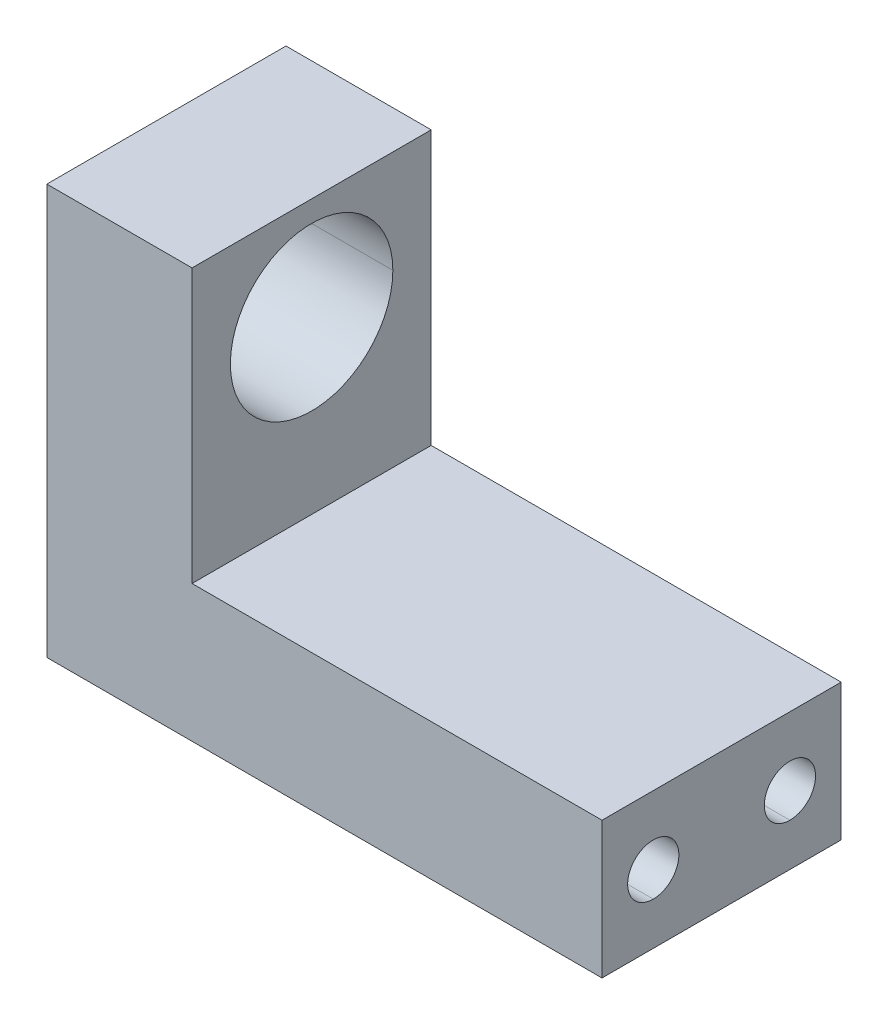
ISO-10303-21;
HEADER;
FILE_DESCRIPTION(('STEP AP214'),'2;1');
FILE_NAME('part.step','',(''),(''),'','','');
FILE_SCHEMA(('AUTOMOTIVE_DESIGN { 1 0 10303 214 1 1 1 1 }'));
ENDSEC;
DATA;
#1=APPLICATION_CONTEXT('core data for automotive mechanical design processes');
#2=APPLICATION_PROTOCOL_DEFINITION('international standard','automotive_design',2000,#1);
#3=PRODUCT_CONTEXT('',#1,'mechanical');
#4=PRODUCT('Part','Part','',(#3));
#5=PRODUCT_RELATED_PRODUCT_CATEGORY('part','',(#4));
#6=PRODUCT_DEFINITION_FORMATION('','',#4);
#7=PRODUCT_DEFINITION_CONTEXT('part definition',#1,'design');
#8=PRODUCT_DEFINITION('design','',#6,#7);
#9=PRODUCT_DEFINITION_SHAPE('','',#8);
#10=(LENGTH_UNIT() NAMED_UNIT(*) SI_UNIT(.MILLI.,.METRE.));
#11=(NAMED_UNIT(*) PLANE_ANGLE_UNIT() SI_UNIT($,.RADIAN.));
#12=(NAMED_UNIT(*) SI_UNIT($,.STERADIAN.) SOLID_ANGLE_UNIT());
#13=UNCERTAINTY_MEASURE_WITH_UNIT(LENGTH_MEASURE(1.E-05),#10,'distance_accuracy_value','');
#14=(GEOMETRIC_REPRESENTATION_CONTEXT(3) GLOBAL_UNCERTAINTY_ASSIGNED_CONTEXT((#13)) GLOBAL_UNIT_ASSIGNED_CONTEXT((#10,
#11,#12)) REPRESENTATION_CONTEXT('',''));
#15=CARTESIAN_POINT('',(0.,0.,0.));
#16=DIRECTION('',(0.,0.,1.));
#17=DIRECTION('',(1.,0.,0.));
#18=AXIS2_PLACEMENT_3D('',#15,#16,#17);
#19=CARTESIAN_POINT('',(19.84375,-25.399999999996,-12.6999999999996));
#20=DIRECTION('',(-1.,0.,0.));
#21=DIRECTION('',(0.,0.,1.));
#22=AXIS2_PLACEMENT_3D('',#19,#20,#21);
#23=PLANE('',#22);
#24=CARTESIAN_POINT('',(19.84375,-25.399999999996,-12.6999999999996));
#25=DIRECTION('',(-1.,0.,0.));
#26=DIRECTION('',(0.,0.,1.));
#27=AXIS2_PLACEMENT_3D('',#24,#25,#26);
#28=CIRCLE('',#27,4.7625);
#29=CARTESIAN_POINT('',(19.84375,-30.162499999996,-12.6999999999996));
#30=VERTEX_POINT('',#29);
#31=CARTESIAN_POINT('',(19.84375,-20.637499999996,-12.6999999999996));
#32=VERTEX_POINT('',#31);
#33=EDGE_CURVE('E119',#30,#32,#28,.F.);
#34=ORIENTED_EDGE('',*,*,#33,.T.);
#35=CARTESIAN_POINT('',(19.84375,-25.399999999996,-12.6999999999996));
#36=DIRECTION('',(-1.,0.,0.));
#37=DIRECTION('',(0.,0.,1.));
#38=AXIS2_PLACEMENT_3D('',#35,#36,#37);
#39=CIRCLE('',#38,4.7625);
#40=EDGE_CURVE('E156',#32,#30,#39,.F.);
#41=ORIENTED_EDGE('',*,*,#40,.T.);
#42=EDGE_LOOP('',(#34,#41));
#43=FACE_BOUND('',#42,.T.);
#44=ADVANCED_FACE('F16',(#43),#23,.F.);
#45=CARTESIAN_POINT('',(19.84375,-25.399999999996,12.7000000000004));
#46=DIRECTION('',(-1.,0.,0.));
#47=DIRECTION('',(0.,0.,1.));
#48=AXIS2_PLACEMENT_3D('',#45,#46,#47);
#49=PLANE('',#48);
#50=CARTESIAN_POINT('',(19.84375,-25.399999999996,12.7000000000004));
#51=DIRECTION('',(-1.,0.,0.));
#52=DIRECTION('',(0.,0.,1.));
#53=AXIS2_PLACEMENT_3D('',#50,#51,#52);
#54=CIRCLE('',#53,4.7625);
#55=CARTESIAN_POINT('',(19.84375,-30.162499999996,12.7000000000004));
#56=VERTEX_POINT('',#55);
#57=CARTESIAN_POINT('',(19.84375,-20.637499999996,12.7000000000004));
#58=VERTEX_POINT('',#57);
#59=EDGE_CURVE('E153',#56,#58,#54,.F.);
#60=ORIENTED_EDGE('',*,*,#59,.T.);
#61=CARTESIAN_POINT('',(19.84375,-25.399999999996,12.7000000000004));
#62=DIRECTION('',(-1.,0.,0.));
#63=DIRECTION('',(0.,0.,1.));
#64=AXIS2_PLACEMENT_3D('',#61,#62,#63);
#65=CIRCLE('',#64,4.7625);
#66=EDGE_CURVE('E149',#58,#56,#65,.F.);
#67=ORIENTED_EDGE('',*,*,#66,.T.);
#68=EDGE_LOOP('',(#60,#67));
#69=FACE_BOUND('',#68,.T.);
#70=ADVANCED_FACE('F171',(#69),#49,.F.);
#71=CARTESIAN_POINT('',(-37.30625,19.0500000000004,-3.60955709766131E-13));
#72=DIRECTION('',(1.,0.,0.));
#73=DIRECTION('',(0.,1.,0.));
#74=AXIS2_PLACEMENT_3D('',#71,#72,#73);
#75=CYLINDRICAL_SURFACE('',#74,15.1003);
#76=CARTESIAN_POINT('',(-24.60625,19.0500000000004,-3.60955709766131E-13));
#77=DIRECTION('',(1.,0.,0.));
#78=DIRECTION('',(0.,1.,0.));
#79=AXIS2_PLACEMENT_3D('',#76,#77,#78);
#80=CIRCLE('',#79,15.1003);
#81=CARTESIAN_POINT('',(-24.60625,19.0500000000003,-15.1003000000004));
#82=VERTEX_POINT('',#81);
#83=CARTESIAN_POINT('',(-24.60625,19.0500000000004,15.1002999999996));
#84=VERTEX_POINT('',#83);
#85=EDGE_CURVE('E116',#82,#84,#80,.F.);
#86=ORIENTED_EDGE('',*,*,#85,.F.);
#87=DIRECTION('',(1.,0.,0.));
#88=VECTOR('',#87,1.);
#89=CARTESIAN_POINT('',(-37.30625,19.0500000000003,-15.1003000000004));
#90=LINE('',#89,#88);
#91=CARTESIAN_POINT('',(-51.59375,19.0500000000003,-15.1003000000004));
#92=VERTEX_POINT('',#91);
#93=EDGE_CURVE('E108',#82,#92,#90,.F.);
#94=ORIENTED_EDGE('',*,*,#93,.T.);
#95=CARTESIAN_POINT('',(-51.59375,19.0500000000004,-3.60955709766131E-13));
#96=DIRECTION('',(1.,0.,0.));
#97=DIRECTION('',(0.,1.,0.));
#98=AXIS2_PLACEMENT_3D('',#95,#96,#97);
#99=CIRCLE('',#98,15.1003);
#100=CARTESIAN_POINT('',(-51.59375,19.0500000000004,15.1002999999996));
#101=VERTEX_POINT('',#100);
#102=EDGE_CURVE('E146',#101,#92,#99,.T.);
#103=ORIENTED_EDGE('',*,*,#102,.F.);
#104=DIRECTION('',(1.,0.,0.));
#105=VECTOR('',#104,1.);
#106=CARTESIAN_POINT('',(-37.30625,19.0500000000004,15.1002999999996));
#107=LINE('',#106,#105);
#108=EDGE_CURVE('E103',#101,#84,#107,.T.);
#109=ORIENTED_EDGE('',*,*,#108,.T.);
#110=EDGE_LOOP('',(#86,#94,#103,#109));
#111=FACE_BOUND('',#110,.T.);
#112=ADVANCED_FACE('F117',(#111),#75,.F.);
#113=CARTESIAN_POINT('',(-37.30625,19.0500000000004,-3.60955709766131E-13));
#114=DIRECTION('',(1.,0.,0.));
#115=DIRECTION('',(0.,1.,0.));
#116=AXIS2_PLACEMENT_3D('',#113,#114,#115);
#117=CYLINDRICAL_SURFACE('',#116,15.1003);
#118=CARTESIAN_POINT('',(-51.59375,19.0500000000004,-3.60955709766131E-13));
#119=DIRECTION('',(1.,0.,0.));
#120=DIRECTION('',(0.,1.,0.));
#121=AXIS2_PLACEMENT_3D('',#118,#119,#120);
#122=CIRCLE('',#121,15.1003);
#123=EDGE_CURVE('E113',#92,#101,#122,.T.);
#124=ORIENTED_EDGE('',*,*,#123,.F.);
#125=ORIENTED_EDGE('',*,*,#93,.F.);
#126=CARTESIAN_POINT('',(-24.60625,19.0500000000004,-3.60955709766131E-13));
#127=DIRECTION('',(1.,0.,0.));
#128=DIRECTION('',(0.,1.,0.));
#129=AXIS2_PLACEMENT_3D('',#126,#127,#128);
#130=CIRCLE('',#129,15.1003);
#131=EDGE_CURVE('E19',#84,#82,#130,.F.);
#132=ORIENTED_EDGE('',*,*,#131,.F.);
#133=ORIENTED_EDGE('',*,*,#108,.F.);
#134=EDGE_LOOP('',(#124,#125,#132,#133));
#135=FACE_BOUND('',#134,.T.);
#136=ADVANCED_FACE('F109',(#135),#117,.F.);
#137=CARTESIAN_POINT('',(-51.59375,38.1,28.5749999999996));
#138=DIRECTION('',(0.,1.,0.));
#139=DIRECTION('',(0.,0.,1.));
#140=AXIS2_PLACEMENT_3D('',#137,#138,#139);
#141=PLANE('',#140);
#142=DIRECTION('',(-1.,0.,0.));
#143=VECTOR('',#142,1.);
#144=CARTESIAN_POINT('',(-5.55625,38.1,-22.2249999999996));
#145=LINE('',#144,#143);
#146=CARTESIAN_POINT('',(-51.59375,38.1,-22.2249999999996));
#147=VERTEX_POINT('',#146);
#148=CARTESIAN_POINT('',(-24.60625,38.1,-22.2249999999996));
#149=VERTEX_POINT('',#148);
#150=EDGE_CURVE('E293',#147,#149,#145,.F.);
#151=ORIENTED_EDGE('',*,*,#150,.F.);
#152=DIRECTION('',(0.,0.,1.));
#153=VECTOR('',#152,1.);
#154=CARTESIAN_POINT('',(-51.59375,38.1,28.5749999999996));
#155=LINE('',#154,#153);
#156=CARTESIAN_POINT('',(-51.59375,38.1,22.2249999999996));
#157=VERTEX_POINT('',#156);
#158=EDGE_CURVE('E148',#157,#147,#155,.F.);
#159=ORIENTED_EDGE('',*,*,#158,.F.);
#160=DIRECTION('',(1.,0.,0.));
#161=VECTOR('',#160,1.);
#162=CARTESIAN_POINT('',(-5.55625,38.1,22.2249999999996));
#163=LINE('',#162,#161);
#164=CARTESIAN_POINT('',(-24.60625,38.1,22.2249999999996));
#165=VERTEX_POINT('',#164);
#166=EDGE_CURVE('E308',#165,#157,#163,.F.);
#167=ORIENTED_EDGE('',*,*,#166,.F.);
#168=DIRECTION('',(0.,0.,-1.));
#169=VECTOR('',#168,1.);
#170=CARTESIAN_POINT('',(-24.60625,38.1,28.5749999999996));
#171=LINE('',#170,#169);
#172=EDGE_CURVE('E122',#149,#165,#171,.F.);
#173=ORIENTED_EDGE('',*,*,#172,.F.);
#174=EDGE_LOOP('',(#151,#159,#167,#173));
#175=FACE_BOUND('',#174,.T.);
#176=ADVANCED_FACE('F218',(#175),#141,.T.);
#177=CARTESIAN_POINT('',(-24.60625,38.1,28.5749999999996));
#178=DIRECTION('',(1.,0.,0.));
#179=DIRECTION('',(0.,0.,-1.));
#180=AXIS2_PLACEMENT_3D('',#177,#178,#179);
#181=PLANE('',#180);
#182=ORIENTED_EDGE('',*,*,#131,.T.);
#183=ORIENTED_EDGE('',*,*,#85,.T.);
#184=EDGE_LOOP('',(#182,#183));
#185=FACE_BOUND('',#184,.T.);
#186=DIRECTION('',(0.,1.,0.));
#187=VECTOR('',#186,1.);
#188=CARTESIAN_POINT('',(-24.60625,0.,-22.2249999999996));
#189=LINE('',#188,#187);
#190=CARTESIAN_POINT('',(-24.60625,-12.7,-22.2249999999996));
#191=VERTEX_POINT('',#190);
#192=EDGE_CURVE('E297',#149,#191,#189,.F.);
#193=ORIENTED_EDGE('',*,*,#192,.F.);
#194=ORIENTED_EDGE('',*,*,#172,.T.);
#195=DIRECTION('',(0.,1.,0.));
#196=VECTOR('',#195,1.);
#197=CARTESIAN_POINT('',(-24.60625,0.,22.2249999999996));
#198=LINE('',#197,#196);
#199=CARTESIAN_POINT('',(-24.60625,-12.7,22.2249999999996));
#200=VERTEX_POINT('',#199);
#201=EDGE_CURVE('E310',#200,#165,#198,.T.);
#202=ORIENTED_EDGE('',*,*,#201,.F.);
#203=DIRECTION('',(0.,0.,-1.));
#204=VECTOR('',#203,1.);
#205=CARTESIAN_POINT('',(-24.60625,-12.7,6.34999999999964));
#206=LINE('',#205,#204);
#207=EDGE_CURVE('E316',#200,#191,#206,.T.);
#208=ORIENTED_EDGE('',*,*,#207,.T.);
#209=EDGE_LOOP('',(#193,#194,#202,#208));
#210=FACE_BOUND('',#209,.T.);
#211=ADVANCED_FACE('F120',(#185,#210),#181,.T.);
#212=CARTESIAN_POINT('',(35.71875,-25.399999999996,-12.6999999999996));
#213=DIRECTION('',(-1.,0.,0.));
#214=DIRECTION('',(0.,0.,1.));
#215=AXIS2_PLACEMENT_3D('',#212,#213,#214);
#216=CYLINDRICAL_SURFACE('',#215,4.7625);
#217=CARTESIAN_POINT('',(51.59375,-25.399999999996,-12.6999999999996));
#218=DIRECTION('',(-1.,0.,0.));
#219=DIRECTION('',(0.,0.,1.));
#220=AXIS2_PLACEMENT_3D('',#217,#218,#219);
#221=CIRCLE('',#220,4.7625);
#222=CARTESIAN_POINT('',(51.59375,-30.162499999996,-12.6999999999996));
#223=VERTEX_POINT('',#222);
#224=CARTESIAN_POINT('',(51.59375,-20.637499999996,-12.6999999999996));
#225=VERTEX_POINT('',#224);
#226=EDGE_CURVE('E141',#223,#225,#221,.F.);
#227=ORIENTED_EDGE('',*,*,#226,.T.);
#228=DIRECTION('',(-1.,0.,0.));
#229=VECTOR('',#228,1.);
#230=CARTESIAN_POINT('',(35.71875,-20.637499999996,-12.6999999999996));
#231=LINE('',#230,#229);
#232=EDGE_CURVE('E129',#225,#32,#231,.T.);
#233=ORIENTED_EDGE('',*,*,#232,.T.);
#234=ORIENTED_EDGE('',*,*,#33,.F.);
#235=DIRECTION('',(-1.,0.,0.));
#236=VECTOR('',#235,1.);
#237=CARTESIAN_POINT('',(35.71875,-30.162499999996,-12.6999999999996));
#238=LINE('',#237,#236);
#239=EDGE_CURVE('E155',#30,#223,#238,.F.);
#240=ORIENTED_EDGE('',*,*,#239,.T.);
#241=EDGE_LOOP('',(#227,#233,#234,#240));
#242=FACE_BOUND('',#241,.T.);
#243=ADVANCED_FACE('F164',(#242),#216,.F.);
#244=CARTESIAN_POINT('',(35.71875,-25.399999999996,-12.6999999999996));
#245=DIRECTION('',(-1.,0.,0.));
#246=DIRECTION('',(0.,0.,1.));
#247=AXIS2_PLACEMENT_3D('',#244,#245,#246);
#248=CYLINDRICAL_SURFACE('',#247,4.7625);
#249=ORIENTED_EDGE('',*,*,#40,.F.);
#250=ORIENTED_EDGE('',*,*,#232,.F.);
#251=CARTESIAN_POINT('',(51.59375,-25.399999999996,-12.6999999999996));
#252=DIRECTION('',(-1.,0.,0.));
#253=DIRECTION('',(0.,0.,1.));
#254=AXIS2_PLACEMENT_3D('',#251,#252,#253);
#255=CIRCLE('',#254,4.7625);
#256=EDGE_CURVE('E138',#225,#223,#255,.F.);
#257=ORIENTED_EDGE('',*,*,#256,.T.);
#258=ORIENTED_EDGE('',*,*,#239,.F.);
#259=EDGE_LOOP('',(#249,#250,#257,#258));
#260=FACE_BOUND('',#259,.T.);
#261=ADVANCED_FACE('F169',(#260),#248,.F.);
#262=CARTESIAN_POINT('',(35.71875,-25.399999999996,12.7000000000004));
#263=DIRECTION('',(-1.,0.,0.));
#264=DIRECTION('',(0.,0.,1.));
#265=AXIS2_PLACEMENT_3D('',#262,#263,#264);
#266=CYLINDRICAL_SURFACE('',#265,4.7625);
#267=CARTESIAN_POINT('',(51.59375,-25.399999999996,12.7000000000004));
#268=DIRECTION('',(-1.,0.,0.));
#269=DIRECTION('',(0.,0.,1.));
#270=AXIS2_PLACEMENT_3D('',#267,#268,#269);
#271=CIRCLE('',#270,4.7625);
#272=CARTESIAN_POINT('',(51.59375,-30.162499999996,12.7000000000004));
#273=VERTEX_POINT('',#272);
#274=CARTESIAN_POINT('',(51.59375,-20.637499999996,12.7000000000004));
#275=VERTEX_POINT('',#274);
#276=EDGE_CURVE('E136',#273,#275,#271,.F.);
#277=ORIENTED_EDGE('',*,*,#276,.T.);
#278=DIRECTION('',(-1.,0.,0.));
#279=VECTOR('',#278,1.);
#280=CARTESIAN_POINT('',(35.71875,-20.637499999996,12.7000000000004));
#281=LINE('',#280,#279);
#282=EDGE_CURVE('E152',#275,#58,#281,.T.);
#283=ORIENTED_EDGE('',*,*,#282,.T.);
#284=ORIENTED_EDGE('',*,*,#59,.F.);
#285=DIRECTION('',(-1.,0.,0.));
#286=VECTOR('',#285,1.);
#287=CARTESIAN_POINT('',(35.71875,-30.162499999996,12.7000000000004));
#288=LINE('',#287,#286);
#289=EDGE_CURVE('E151',#56,#273,#288,.F.);
#290=ORIENTED_EDGE('',*,*,#289,.T.);
#291=EDGE_LOOP('',(#277,#283,#284,#290));
#292=FACE_BOUND('',#291,.T.);
#293=ADVANCED_FACE('F207',(#292),#266,.F.);
#294=CARTESIAN_POINT('',(35.71875,-25.399999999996,12.7000000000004));
#295=DIRECTION('',(-1.,0.,0.));
#296=DIRECTION('',(0.,0.,1.));
#297=AXIS2_PLACEMENT_3D('',#294,#295,#296);
#298=CYLINDRICAL_SURFACE('',#297,4.7625);
#299=ORIENTED_EDGE('',*,*,#66,.F.);
#300=ORIENTED_EDGE('',*,*,#282,.F.);
#301=CARTESIAN_POINT('',(51.59375,-25.399999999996,12.7000000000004));
#302=DIRECTION('',(-1.,0.,0.));
#303=DIRECTION('',(0.,0.,1.));
#304=AXIS2_PLACEMENT_3D('',#301,#302,#303);
#305=CIRCLE('',#304,4.7625);
#306=EDGE_CURVE('E132',#275,#273,#305,.F.);
#307=ORIENTED_EDGE('',*,*,#306,.T.);
#308=ORIENTED_EDGE('',*,*,#289,.F.);
#309=EDGE_LOOP('',(#299,#300,#307,#308));
#310=FACE_BOUND('',#309,.T.);
#311=ADVANCED_FACE('F203',(#310),#298,.F.);
#312=CARTESIAN_POINT('',(13.49375,-12.7,6.34999999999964));
#313=DIRECTION('',(0.,-1.,0.));
#314=DIRECTION('',(0.,0.,-1.));
#315=AXIS2_PLACEMENT_3D('',#312,#313,#314);
#316=PLANE('',#315);
#317=DIRECTION('',(0.,0.,1.));
#318=VECTOR('',#317,1.);
#319=CARTESIAN_POINT('',(51.59375,-12.7,6.34999999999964));
#320=LINE('',#319,#318);
#321=CARTESIAN_POINT('',(51.59375,-12.7,22.2249999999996));
#322=VERTEX_POINT('',#321);
#323=CARTESIAN_POINT('',(51.59375,-12.7,-22.2249999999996));
#324=VERTEX_POINT('',#323);
#325=EDGE_CURVE('E135',#322,#324,#320,.F.);
#326=ORIENTED_EDGE('',*,*,#325,.T.);
#327=DIRECTION('',(-1.,0.,0.));
#328=VECTOR('',#327,1.);
#329=CARTESIAN_POINT('',(-5.55625,-12.7,-22.2249999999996));
#330=LINE('',#329,#328);
#331=EDGE_CURVE('E143',#191,#324,#330,.F.);
#332=ORIENTED_EDGE('',*,*,#331,.F.);
#333=ORIENTED_EDGE('',*,*,#207,.F.);
#334=DIRECTION('',(1.,0.,0.));
#335=VECTOR('',#334,1.);
#336=CARTESIAN_POINT('',(-5.55625,-12.7,22.2249999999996));
#337=LINE('',#336,#335);
#338=EDGE_CURVE('E313',#322,#200,#337,.F.);
#339=ORIENTED_EDGE('',*,*,#338,.F.);
#340=EDGE_LOOP('',(#326,#332,#333,#339));
#341=FACE_BOUND('',#340,.T.);
#342=ADVANCED_FACE('F199',(#341),#316,.F.);
#343=CARTESIAN_POINT('',(-5.55625,0.,22.2249999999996));
#344=DIRECTION('',(0.,0.,1.));
#345=DIRECTION('',(1.,0.,0.));
#346=AXIS2_PLACEMENT_3D('',#343,#344,#345);
#347=PLANE('',#346);
#348=DIRECTION('',(1.,0.,0.));
#349=VECTOR('',#348,1.);
#350=CARTESIAN_POINT('',(0.,-38.1,22.2249999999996));
#351=LINE('',#350,#349);
#352=CARTESIAN_POINT('',(51.59375,-38.1,22.2249999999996));
#353=VERTEX_POINT('',#352);
#354=CARTESIAN_POINT('',(-51.59375,-38.1,22.2249999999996));
#355=VERTEX_POINT('',#354);
#356=EDGE_CURVE('E337',#353,#355,#351,.F.);
#357=ORIENTED_EDGE('',*,*,#356,.F.);
#358=DIRECTION('',(0.,1.,0.));
#359=VECTOR('',#358,1.);
#360=CARTESIAN_POINT('',(51.59375,-38.1,22.2249999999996));
#361=LINE('',#360,#359);
#362=EDGE_CURVE('E334',#353,#322,#361,.T.);
#363=ORIENTED_EDGE('',*,*,#362,.T.);
#364=ORIENTED_EDGE('',*,*,#338,.T.);
#365=ORIENTED_EDGE('',*,*,#201,.T.);
#366=ORIENTED_EDGE('',*,*,#166,.T.);
#367=DIRECTION('',(0.,1.,0.));
#368=VECTOR('',#367,1.);
#369=CARTESIAN_POINT('',(-51.59375,-27.7622000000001,22.2249999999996));
#370=LINE('',#369,#368);
#371=EDGE_CURVE('E306',#355,#157,#370,.T.);
#372=ORIENTED_EDGE('',*,*,#371,.F.);
#373=EDGE_LOOP('',(#357,#363,#364,#365,#366,#372));
#374=FACE_BOUND('',#373,.T.);
#375=ADVANCED_FACE('F195',(#374),#347,.T.);
#376=CARTESIAN_POINT('',(-51.59375,-27.7622000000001,28.5749999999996));
#377=DIRECTION('',(-1.,0.,0.));
#378=DIRECTION('',(0.,0.,1.));
#379=AXIS2_PLACEMENT_3D('',#376,#377,#378);
#380=PLANE('',#379);
#381=ORIENTED_EDGE('',*,*,#102,.T.);
#382=ORIENTED_EDGE('',*,*,#123,.T.);
#383=EDGE_LOOP('',(#381,#382));
#384=FACE_BOUND('',#383,.T.);
#385=DIRECTION('',(0.,1.,0.));
#386=VECTOR('',#385,1.);
#387=CARTESIAN_POINT('',(-51.59375,0.,-22.2249999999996));
#388=LINE('',#387,#386);
#389=CARTESIAN_POINT('',(-51.59375,-38.1,-22.2249999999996));
#390=VERTEX_POINT('',#389);
#391=EDGE_CURVE('E145',#390,#147,#388,.T.);
#392=ORIENTED_EDGE('',*,*,#391,.F.);
#393=DIRECTION('',(0.,0.,-1.));
#394=VECTOR('',#393,1.);
#395=CARTESIAN_POINT('',(-51.59375,-38.1,3.60955709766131E-13));
#396=LINE('',#395,#394);
#397=EDGE_CURVE('E340',#355,#390,#396,.T.);
#398=ORIENTED_EDGE('',*,*,#397,.F.);
#399=ORIENTED_EDGE('',*,*,#371,.T.);
#400=ORIENTED_EDGE('',*,*,#158,.T.);
#401=EDGE_LOOP('',(#392,#398,#399,#400));
#402=FACE_BOUND('',#401,.T.);
#403=ADVANCED_FACE('F192',(#384,#402),#380,.T.);
#404=CARTESIAN_POINT('',(-5.55625,0.,-22.2249999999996));
#405=DIRECTION('',(0.,0.,-1.));
#406=DIRECTION('',(-1.,0.,0.));
#407=AXIS2_PLACEMENT_3D('',#404,#405,#406);
#408=PLANE('',#407);
#409=DIRECTION('',(0.,1.,0.));
#410=VECTOR('',#409,1.);
#411=CARTESIAN_POINT('',(51.59375,-38.1,-22.2249999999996));
#412=LINE('',#411,#410);
#413=CARTESIAN_POINT('',(51.59375,-38.1,-22.2249999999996));
#414=VERTEX_POINT('',#413);
#415=EDGE_CURVE('E34',#324,#414,#412,.F.);
#416=ORIENTED_EDGE('',*,*,#415,.T.);
#417=DIRECTION('',(1.,0.,0.));
#418=VECTOR('',#417,1.);
#419=CARTESIAN_POINT('',(0.,-38.1,-22.2249999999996));
#420=LINE('',#419,#418);
#421=EDGE_CURVE('E25',#390,#414,#420,.T.);
#422=ORIENTED_EDGE('',*,*,#421,.F.);
#423=ORIENTED_EDGE('',*,*,#391,.T.);
#424=ORIENTED_EDGE('',*,*,#150,.T.);
#425=ORIENTED_EDGE('',*,*,#192,.T.);
#426=ORIENTED_EDGE('',*,*,#331,.T.);
#427=EDGE_LOOP('',(#416,#422,#423,#424,#425,#426));
#428=FACE_BOUND('',#427,.T.);
#429=ADVANCED_FACE('F185',(#428),#408,.T.);
#430=CARTESIAN_POINT('',(51.59375,-38.1,6.34999999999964));
#431=DIRECTION('',(-1.,0.,0.));
#432=DIRECTION('',(0.,0.,1.));
#433=AXIS2_PLACEMENT_3D('',#430,#431,#432);
#434=PLANE('',#433);
#435=DIRECTION('',(0.,0.,-1.));
#436=VECTOR('',#435,1.);
#437=CARTESIAN_POINT('',(51.59375,-38.1,3.60955709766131E-13));
#438=LINE('',#437,#436);
#439=EDGE_CURVE('E11',#414,#353,#438,.F.);
#440=ORIENTED_EDGE('',*,*,#439,.F.);
#441=ORIENTED_EDGE('',*,*,#415,.F.);
#442=ORIENTED_EDGE('',*,*,#325,.F.);
#443=ORIENTED_EDGE('',*,*,#362,.F.);
#444=EDGE_LOOP('',(#440,#441,#442,#443));
#445=FACE_BOUND('',#444,.T.);
#446=ORIENTED_EDGE('',*,*,#276,.F.);
#447=ORIENTED_EDGE('',*,*,#306,.F.);
#448=EDGE_LOOP('',(#446,#447));
#449=FACE_BOUND('',#448,.T.);
#450=ORIENTED_EDGE('',*,*,#226,.F.);
#451=ORIENTED_EDGE('',*,*,#256,.F.);
#452=EDGE_LOOP('',(#450,#451));
#453=FACE_BOUND('',#452,.T.);
#454=ADVANCED_FACE('F179',(#445,#449,#453),#434,.F.);
#455=CARTESIAN_POINT('',(0.,-38.1,3.60955709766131E-13));
#456=DIRECTION('',(0.,-1.,0.));
#457=DIRECTION('',(0.,0.,-1.));
#458=AXIS2_PLACEMENT_3D('',#455,#456,#457);
#459=PLANE('',#458);
#460=ORIENTED_EDGE('',*,*,#421,.T.);
#461=ORIENTED_EDGE('',*,*,#439,.T.);
#462=ORIENTED_EDGE('',*,*,#356,.T.);
#463=ORIENTED_EDGE('',*,*,#397,.T.);
#464=EDGE_LOOP('',(#460,#461,#462,#463));
#465=FACE_BOUND('',#464,.T.);
#466=ADVANCED_FACE('F177',(#465),#459,.T.);
#467=CLOSED_SHELL('',(#44,#70,#112,#136,#176,#211,#243,#261,#293,#311,#342,#375,#403,#429,#454,#466));
#468=MANIFOLD_SOLID_BREP('B1',#467);
#469=ADVANCED_BREP_SHAPE_REPRESENTATION('',(#18,#468),#14);
#470=SHAPE_DEFINITION_REPRESENTATION(#9,#469);
ENDSEC;
END-ISO-10303-21;
